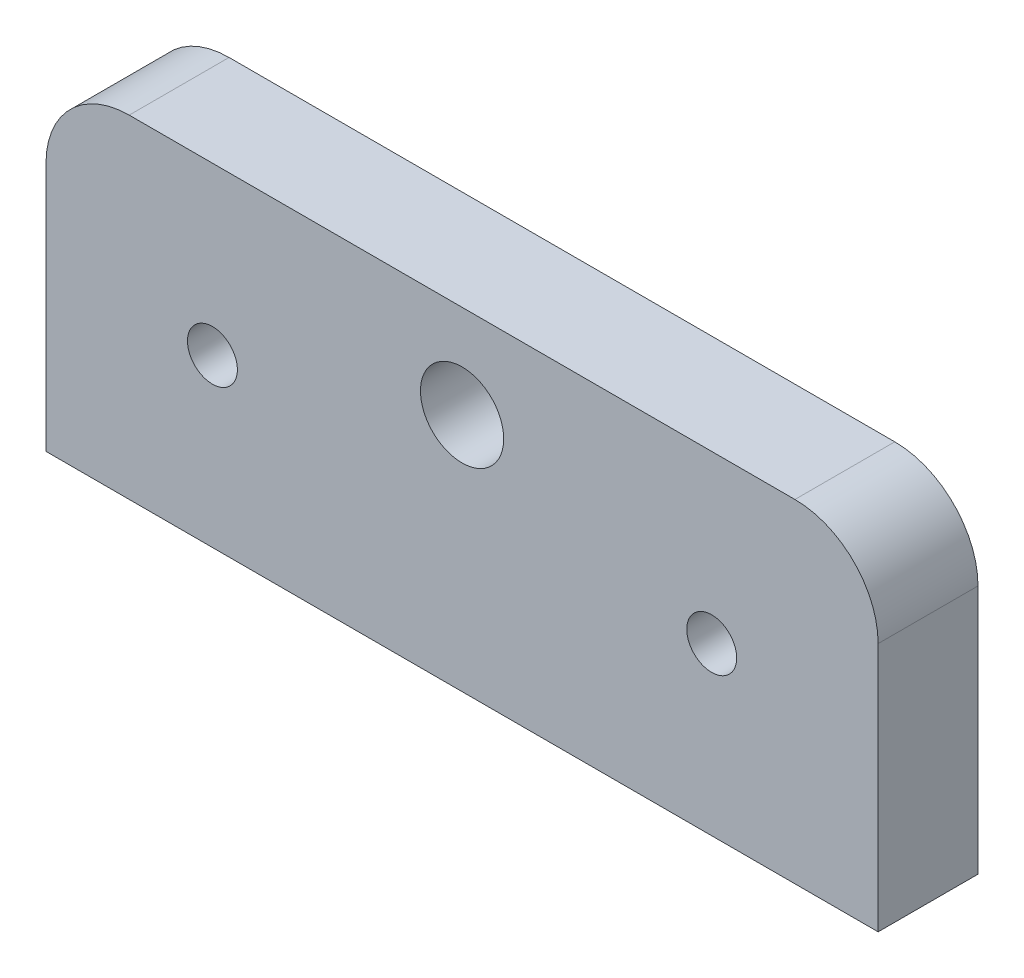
from build123d import *

# Parameters (mm, degrees)
ESQUISSE1_W             = 50
ESQUISSE1_H             = 20
EXTRUSION1_DEPTH        = 6
ESQUISSE2_R             = 2.5
ESQUISSE2_R_2           = 1.5
ENL_V_MAT_EXTRU_1_DEPTH = 6
CONG_1_R                = 5


with BuildPart() as part:
    # Esquisse1 → Extrusion1 (new body)
    with BuildSketch(Plane.XY):
        with Locations((-34.038673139, -25.86828479)):
            Rectangle(ESQUISSE1_W, ESQUISSE1_H)
    extrude(amount=EXTRUSION1_DEPTH)

    # Esquisse2 → Enl_v. mat.-Extru.1 (cut)
    with BuildSketch(Plane.XY.offset(6)):
        with Locations((-34.038673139, -21.46828479)):
            Circle(ESQUISSE2_R)
        with Locations((-19.038673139, -25.86828479)):
            Circle(ESQUISSE2_R_2)
        with Locations((-49.038673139, -25.86828479)):
            Circle(ESQUISSE2_R_2)
    extrude(amount=-ENL_V_MAT_EXTRU_1_DEPTH, mode=Mode.SUBTRACT)

    # Cong_1
    cong_1_edges = [part.edges().sort_by_distance(p)[0] for p in [
        (-59.038673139, -15.86828479, 3),
        (-9.038673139, -15.86828479, 3),
    ]]
    fillet(cong_1_edges, radius=CONG_1_R)


solid = part.part
